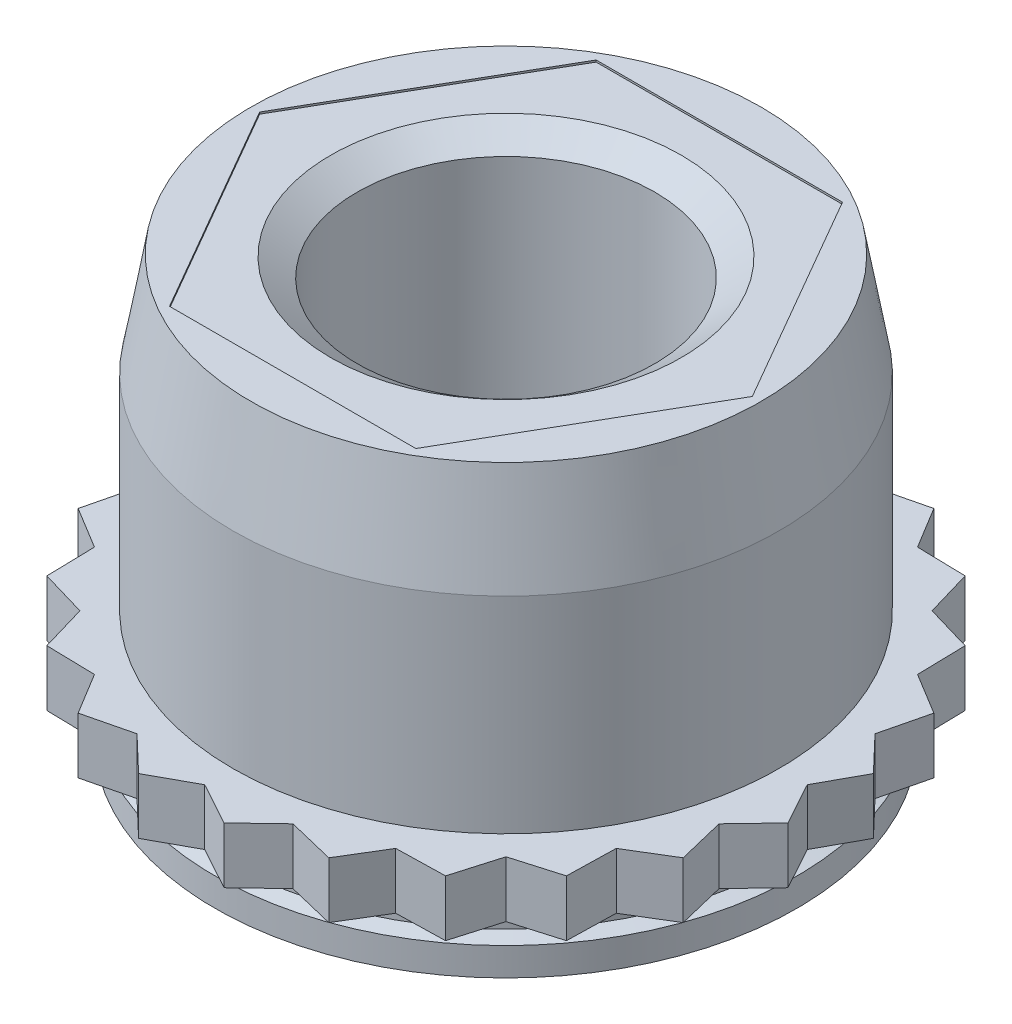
from build123d import *

# Parameters (mm, degrees)
CLINCHCUT_START    = -0.762
CLINCHCUT_DEPTH    = 0.762
CLINCHCUTPAT_COUNT = 24
CLINCHCUTPAT_ANGLE = 345
HEXCUT_DEPTH       = 0.0254


with BuildPart() as part:
    # BodySke → Body (revolve)
    with BuildSketch(Plane.XY, mode=Mode.PRIVATE) as body_sk:
        Polygon((3.752215, -1.090084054), (3.752215, -0.762), (4.445, -0.762), (4.445, 0), (3.7084, 0), (3.7084, 2.794), (3.462071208, 4.191), (2.0193, 4.191), (2.0193, -1.524), (3.9497, -1.524), (3.9497, -1.143), align=None)
    revolve(body_sk.sketch.rotate(Axis((0, -1.143, 0), (0, 1, 0)), 90), axis=Axis((0, -1.143, 0), (0, 1, 0)))

    # EndChamferSke → EndChamfer (revolve, cut)
    with BuildSketch(Plane.XY, mode=Mode.PRIVATE) as endchamfer_sk:
        Polygon((2.413, -1.778), (2.413, -1.52146), (2.0193, -1.245890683), (2.0193, -1.778), align=None)
        Polygon((2.413, 4.18846), (2.413, 4.445), (2.0193, 4.445), (2.0193, 3.912890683), align=None)
    revolve(endchamfer_sk.sketch.rotate(Axis((0, -2.54, 0), (0, 1, 0)), 90), axis=Axis((0, -2.54, 0), (0, 1, 0)), mode=Mode.SUBTRACT)

    # CliRinCutSke → ClinchCut (cut)
    with BuildSketch(Plane.XZ.offset(0.762).offset(CLINCHCUT_START)):
        with BuildLine():
            Line((0.580188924, 4.406972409), (0, 4.0894))
            Line((0, 4.0894), (-0.580188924, 4.406972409))
            ThreePointArc((-0.580188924, 4.406972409), (0, 4.445), (0.580188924, 4.406972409))
        make_face()
    clinchcut = extrude(amount=CLINCHCUT_DEPTH, mode=Mode.SUBTRACT)

    # ClinchCutPat: ClinchCut ×24 about axis
    clinchcutpat_axis = Axis((0, 0, 0), (0, 1, 0))
    for i in range(1, CLINCHCUTPAT_COUNT):
        add(clinchcut.rotate(clinchcutpat_axis, i * CLINCHCUTPAT_ANGLE / (CLINCHCUTPAT_COUNT - 1)), mode=Mode.SUBTRACT)

    # HexCutSke → HexCut (cut)
    with BuildSketch(Plane(origin=(0, 4.191, 0), x_dir=(-1, 0, 0), z_dir=(0, 1, 0))):
        Polygon((-1.671775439, 2.8956), (1.671775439, 2.8956), (3.343550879, 0), (1.671775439, -2.8956), (-1.671775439, -2.8956), (-3.343550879, 0), align=None)
    extrude(amount=-HEXCUT_DEPTH, mode=Mode.SUBTRACT)


solid = part.part
